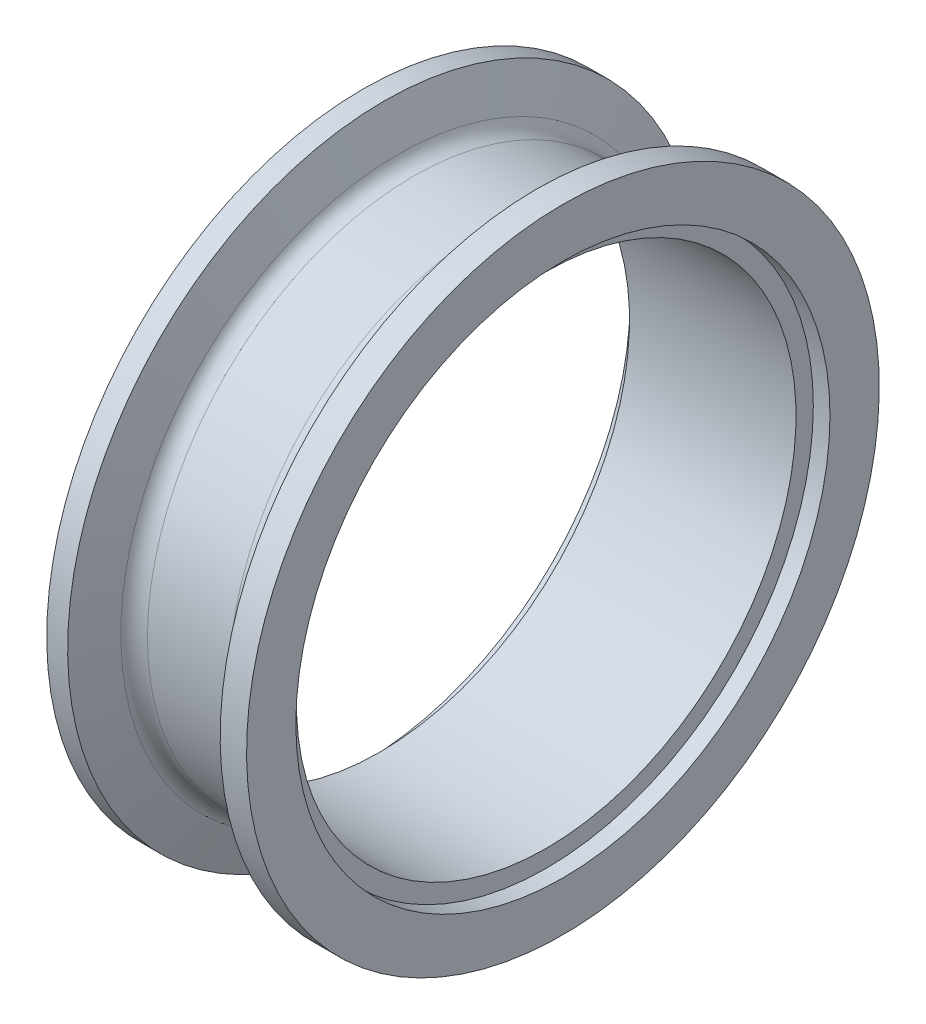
from build123d import *


with BuildPart() as part:
    # Sketch1 → Revolve1 (revolve)
    with BuildSketch(Plane.XY):
        with BuildLine():
            Line((0, 60.325), (3.9878, 60.325))
            Line((3.9878, 60.325), (6.694251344, 52.889086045))
            ThreePointArc((6.694251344, 52.889086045), (7.85667023, 51.374192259), (9.677775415, 50.8))
            Line((9.677775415, 50.8), (25.157665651, 50.8))
            ThreePointArc((25.157665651, 50.8), (28.799876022, 51.948384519), (31.124713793, 54.97817209))
            Line((31.124713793, 54.97817209), (33.0708, 60.325))
            Line((33.0708, 60.325), (38.1, 60.325))
            Line((38.1, 60.325), (38.1, 50.927))
            Line((38.1, 50.927), (34.925, 50.927))
            Line((34.925, 50.927), (34.925, 47.625))
            Line((34.925, 47.625), (3.175, 47.625))
            Line((3.175, 47.625), (3.175, 50.927))
            Line((3.175, 50.927), (0, 50.927))
            Line((0, 50.927), (0, 60.325))
        make_face()
    revolve(axis=Axis((19.05, 0, 0), (-1, 0, 0)))


solid = part.part
